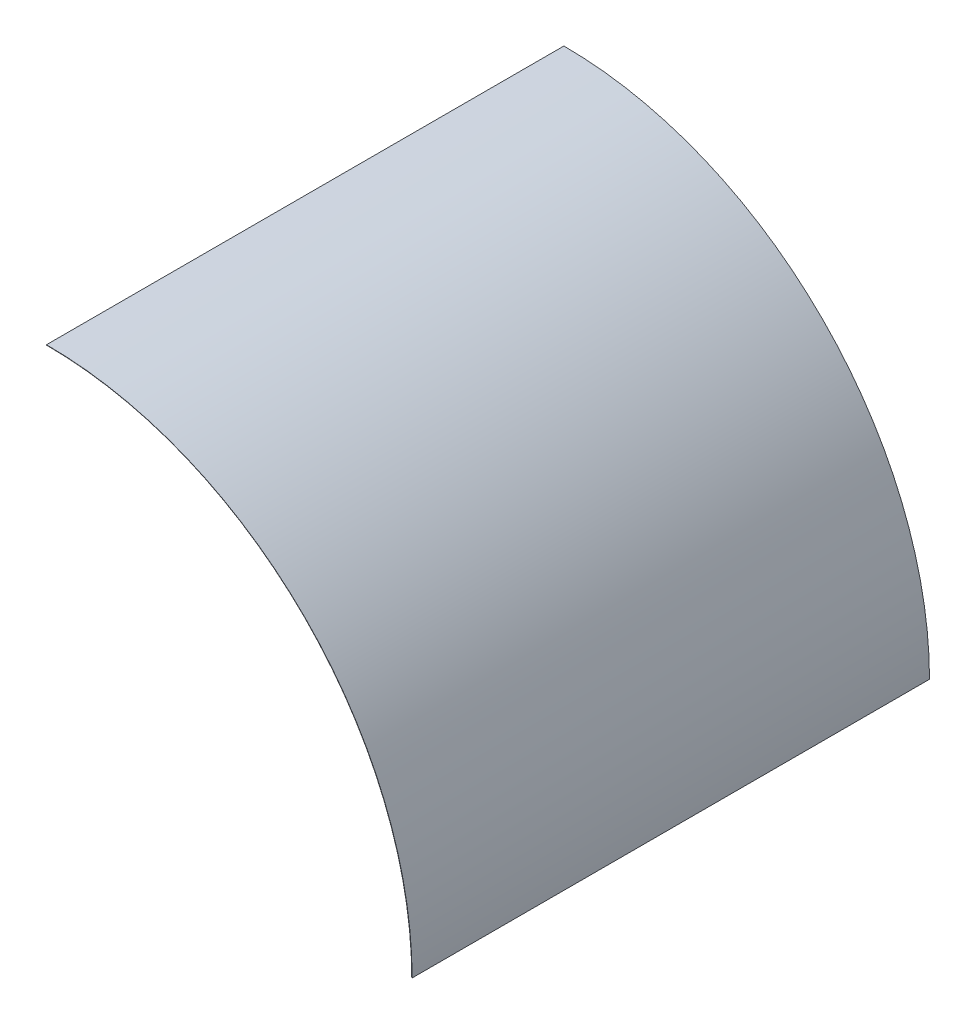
from build123d import *

# Parameters (mm, degrees)
BOSS_EXTRUDE1_DEPTH = 3000


with BuildPart() as part:
    # Sketch1 → Boss-Extrude1 (new body)
    with BuildSketch(Plane.XY):
        with BuildLine():
            Line((0, 2120), (0, 2118))
            ThreePointArc((0, 2118), (1497.652162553, 1497.652162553), (2118, 0))
            Line((2118, 0), (2120, 0))
            ThreePointArc((2120, 0), (1499.066376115, 1499.066376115), (0, 2120))
        make_face()
    extrude(amount=-BOSS_EXTRUDE1_DEPTH)


solid = part.part
